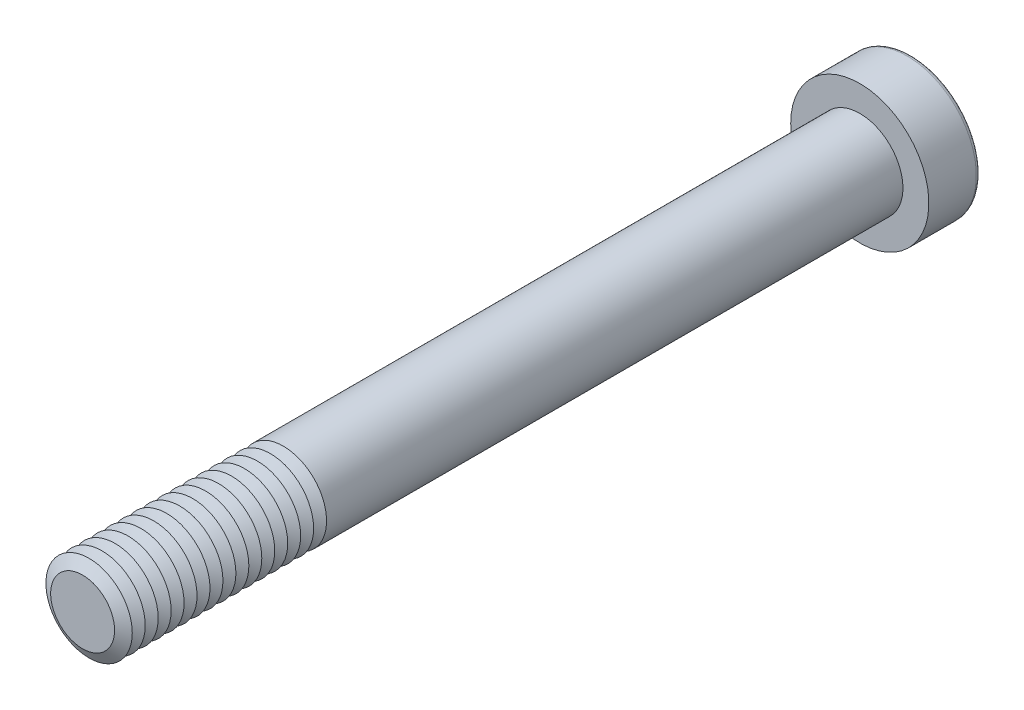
from build123d import *

# Parameters (mm, degrees)
SKETCH1_R           = 5
BOSS_EXTRUDE1_DEPTH = 90
SKETCH2_R           = 8
BOSS_EXTRUDE2_DEPTH = 6
CUT_EXTRUDE1_DEPTH  = 5.25
FILLET1_R           = 0.5
LPATTERN1_COUNT     = 16
LPATTERN1_PITCH     = 1.5


with BuildPart() as part:
    # Sketch1 → Boss-Extrude1 (new body)
    with BuildSketch(Plane.XY):
        with Locations(Location((0, 0, 0), (0, 0, 180))):
            Circle(SKETCH1_R)
    extrude(amount=BOSS_EXTRUDE1_DEPTH)

    # Sketch2 → Boss-Extrude2 (add)
    with BuildSketch(Plane(origin=(0, 0, 0), x_dir=(-1, 0, 0), z_dir=(0, 0, -1))):
        Circle(SKETCH2_R)
    extrude(amount=BOSS_EXTRUDE2_DEPTH)

    # Sketch3 → Cut-Extrude1 (cut)
    with BuildSketch(Plane(origin=(0, 0, -6), x_dir=(-1, 0, 0), z_dir=(0, 0, -1))):
        Polygon((-2.020725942, 3.5), (-4.041451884, 0), (-2.020725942, -3.5), (2.020725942, -3.5), (4.041451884, 0), (2.020725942, 3.5), align=None)
    extrude(amount=-CUT_EXTRUDE1_DEPTH, mode=Mode.SUBTRACT)

    # Fillet1
    fillet1_edges = [part.edges().sort_by_distance(p)[0] for p in [
        (8, 0, -6),
    ]]
    fillet(fillet1_edges, radius=FILLET1_R)

    # Cut-Extrude2 cone 1 section (on through the dimple's axis) → Cut-Extrude2 (revolve, cut)
    with BuildSketch(Plane(origin=(0, 0, -0.75), x_dir=(0, 1, 0), z_dir=(1, 0, 0))):
        Polygon((0, 0), (3.5, 0), (0, 2.020725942), align=None)
    revolve(axis=Axis((0, 0, -0.75), (0, 0, 1)), mode=Mode.SUBTRACT)

    # Cut-Extrude3 cone 1 section (on through the dimple's axis) → Cut-Extrude3 (revolve, cut)
    with BuildSketch(Plane(origin=(0, 0, -6), x_dir=(0, 1, 0), z_dir=(1, 0, 0))):
        Polygon((0, 0), (4.041451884, 0), (0, 1.082903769), align=None)
    revolve(axis=Axis((0, 0, -6), (0, 0, 1)), mode=Mode.SUBTRACT)

    # Sketch7 → Cut-Revolve1 (revolve, cut)
    with BuildSketch(Plane(origin=(0, 0, 0), x_dir=(0, 0, -1), z_dir=(1, 0, 0)), mode=Mode.PRIVATE) as cut_revolve1_sk:
        Polygon((-90, 3.700961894), (-89.25, 5), (-90.75, 5), align=None)
    cut_revolve1 = revolve(cut_revolve1_sk.sketch.rotate(Axis((0, 0, 90), (0, 0, -1)), 270), axis=Axis((0, 0, 90), (0, 0, -1)), mode=Mode.SUBTRACT)

    # LPattern1: Cut-Revolve1 ×16
    with Locations(*[(0, 0, -i * LPATTERN1_PITCH) for i in range(1, LPATTERN1_COUNT)]):
        add(cut_revolve1, mode=Mode.SUBTRACT)


solid = part.part
